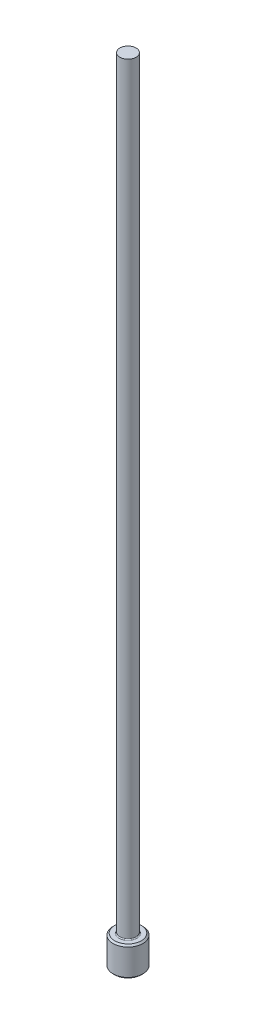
from build123d import *

# Parameters (mm, degrees)
CHAMFER1_SIZE = 0.127
FILLET1_R     = 0.0762


with BuildPart() as part:
    # Sketch1 → Revolve1 (revolve)
    with BuildSketch(Plane.XY, mode=Mode.PRIVATE) as revolve1_sk:
        Polygon((0, 0), (-1.1938, 0), (-1.1938, 2.3622), (-0.6477, 2.3622), (-0.6477, 63.5), (0, 63.5), align=None)
    revolve(revolve1_sk.sketch.rotate(Axis((0, 259.958771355, 0), (0, -1, 0)), 270), axis=Axis((0, 259.958771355, 0), (0, -1, 0)))

    # Chamfer1
    chamfer1_edges = [part.edges().sort_by_distance(p)[0] for p in [
        (0, 2.3622, -1.1938),
        (0, 0, -1.1938),
    ]]
    chamfer(chamfer1_edges, length=CHAMFER1_SIZE)

    # Fillet1
    fillet1_edges = [part.edges().sort_by_distance(p)[0] for p in [
        (0, 2.3622, -0.6477),
    ]]
    fillet(fillet1_edges, radius=FILLET1_R)


solid = part.part
